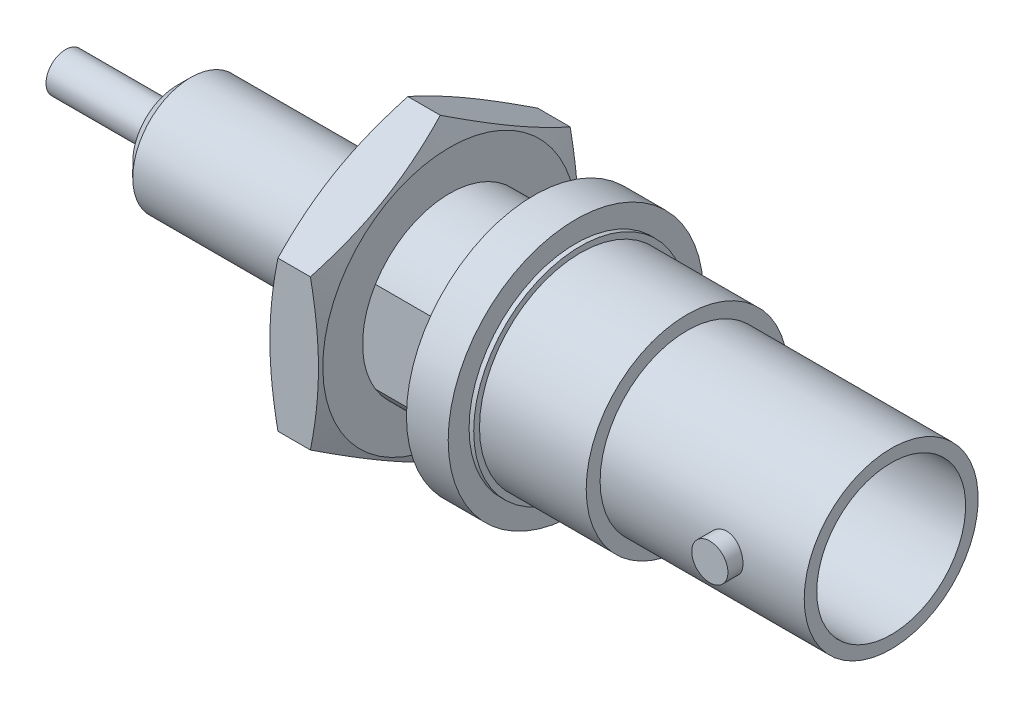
from build123d import *

# Parameters (mm, degrees)
SKETCH8_R           = 0.9906
BOSS_EXTRUDE1_DEPTH = 5.588
SKETCH9_R           = 4.0767
CUT_EXTRUDE3_DEPTH  = 17.272
SKETCH12_W          = 2.879011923
SKETCH12_H          = 9.670612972
CUT_EXTRUDE4_DEPTH  = 8.5852
BOSS_EXTRUDE2_START = 2.794
SKETCH10_R          = 4.7625
BOSS_EXTRUDE2_DEPTH = 2.794
CHAMFER1_SIZE       = 0.762


with BuildPart() as part:
    # Sketch7 → Revolve1 (revolve)
    with BuildSketch(Plane.XY, mode=Mode.PRIVATE) as revolve1_sk:
        Polygon((-25.654, 0), (2.286, 0), (2.286, 4.0767), (19.558, 4.0767), (19.558, 4.7625), (8.382, 4.7625), (8.382, 5.5245), (2.54, 5.5245), (2.54, 5.842), (2.286, 5.842), (2.286, 6.985), (0, 6.985), (0, 4.7625), (-8.5852, 4.7625), (-8.5852, 3.175), (-19.558, 3.175), (-19.558, 1.0668), (-25.654, 1.0668), align=None)
    revolve(revolve1_sk.sketch.rotate(Axis((0, 0, 0), (1, 0, 0)), 90), axis=Axis((0, 0, 0), (1, 0, 0)))

    # Sketch8 → Boss-Extrude1 (add, symmetric)
    with BuildSketch(Plane.XY):
        with Locations(Location((15.2146, 0, 0), (0, 0, 180))):
            Circle(SKETCH8_R)
    extrude(amount=BOSS_EXTRUDE1_DEPTH, both=True)

    # Sketch9 → Cut-Extrude3 (cut)
    with BuildSketch(Plane(origin=(19.558, 0, 0), x_dir=(0, 0, -1), z_dir=(1, 0, 0))):
        with Locations(Location((0, 0, 0), (0, 0, 180))):
            Circle(SKETCH9_R)
    extrude(amount=-CUT_EXTRUDE3_DEPTH, mode=Mode.SUBTRACT)

    # Sketch12 → Cut-Extrude4 (cut)
    with BuildSketch(Plane.ZY):
        with Locations((5.503505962, 0.153664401)):
            Rectangle(SKETCH12_W, SKETCH12_H)
    extrude(amount=CUT_EXTRUDE4_DEPTH, mode=Mode.SUBTRACT)

    # Sketch10 → Boss-Extrude2 (add)
    with BuildSketch(Plane.ZY.offset(4.6228).offset(BOSS_EXTRUDE2_START)):
        Polygon((7.112, 4.106115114), (0, 8.212230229), (-7.112, 4.106115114), (-7.112, -4.106115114), (0, -8.212230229), (7.112, -4.106115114), align=None)
        Circle(SKETCH10_R, mode=Mode.SUBTRACT)
    extrude(amount=-BOSS_EXTRUDE2_DEPTH)

    # Sketch11 → Cut-Revolve1 (revolve, cut)
    with BuildSketch(Plane.XY, mode=Mode.PRIVATE) as cut_revolve1_sk:
        Polygon((-7.4168, 8.212230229), (-6.9088, 8.212230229), (-7.4168, 6.942230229), align=None)
        Polygon((-4.6228, 6.942230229), (-4.6228, 8.212230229), (-5.1308, 8.212230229), align=None)
    revolve(cut_revolve1_sk.sketch.rotate(Axis((0, 0, 0), (-1, 0, 0)), 90), axis=Axis((0, 0, 0), (-1, 0, 0)), mode=Mode.SUBTRACT)

    # Chamfer1
    chamfer1_edges = [part.edges().sort_by_distance(p)[0] for p in [
        (-19.558, 0, -3.175),
    ]]
    chamfer(chamfer1_edges, length=CHAMFER1_SIZE)


solid = part.part
